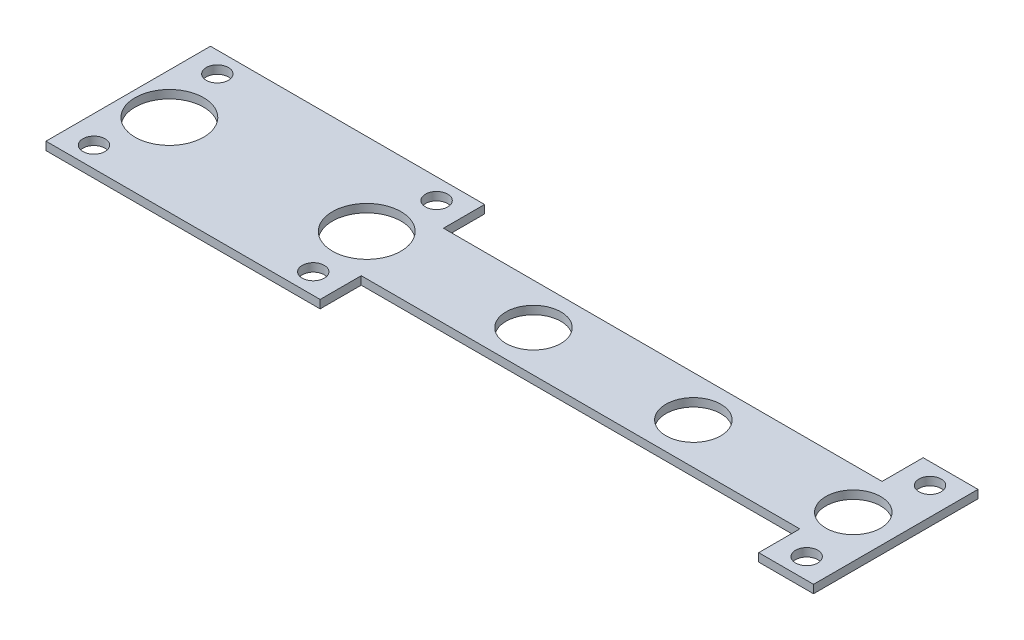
from build123d import *

# Parameters (mm, degrees)
SCHIZZO1_R                   = 4.05
SCHIZZO1_R_2                 = 12.5
SCHIZZO1_R_3                 = 10
ESTRUSIONE_ESTRUSIONE2_DEPTH = 3


with BuildPart() as part:
    # Schizzo1 → Estrusione-Estrusione2 (new body)
    with BuildSketch(Plane(origin=(0, 0, 0), x_dir=(1, 0, 0), z_dir=(0, 1, 0))):
        Polygon((-102.760207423, -29.663091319), (-2.760207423, -29.663091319), (-2.760207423, -14.663091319), (157.239792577, -14.663091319), (157.239792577, -29.663091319), (177.239792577, -29.663091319), (177.239792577, 30.336908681), (157.239792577, 30.336908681), (157.239792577, 15.336908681), (-2.760207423, 15.336908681), (-2.760207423, 30.336908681), (-102.760207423, 30.336908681), align=None)
        with Locations(Location((167.239792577, -22.163091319, 0), (0, 0, 270))):
            Circle(SCHIZZO1_R, mode=Mode.SUBTRACT)
        with Locations(Location((-92.76020742, -22.163091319, 0), (0, 0, 270))):
            Circle(SCHIZZO1_R, mode=Mode.SUBTRACT)
        with Locations(Location((167.239792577, 22.836908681, 0), (0, 0, 270))):
            Circle(SCHIZZO1_R, mode=Mode.SUBTRACT)
        with Locations(Location((-92.76020742, 22.836908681, 0), (0, 0, 270))):
            Circle(SCHIZZO1_R, mode=Mode.SUBTRACT)
        with Locations(Location((-87.760207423, 0.336908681, 0), (0, 0, 270))):
            Circle(SCHIZZO1_R_2, mode=Mode.SUBTRACT)
        with Locations(Location((161.739792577, 0.336908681, 0), (0, 0, 270))):
            Circle(SCHIZZO1_R_3, mode=Mode.SUBTRACT)
        with Locations(Location((-15.760207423, 0.336908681, 0), (0, 0, 270))):
            Circle(SCHIZZO1_R_2, mode=Mode.SUBTRACT)
        with Locations(Location((-12.76020742, -22.163091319, 0), (0, 0, 270))):
            Circle(SCHIZZO1_R, mode=Mode.SUBTRACT)
        with Locations(Location((45.073125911, 0.336908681, 0), (0, 0, 270))):
            Circle(SCHIZZO1_R_3, mode=Mode.SUBTRACT)
        with Locations(Location((103.406459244, 0.336908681, 0), (0, 0, 270))):
            Circle(SCHIZZO1_R_3, mode=Mode.SUBTRACT)
        with Locations(Location((-12.76020742, 22.83690868, 0), (0, 0, 270))):
            Circle(SCHIZZO1_R, mode=Mode.SUBTRACT)
    extrude(amount=ESTRUSIONE_ESTRUSIONE2_DEPTH)


solid = part.part
